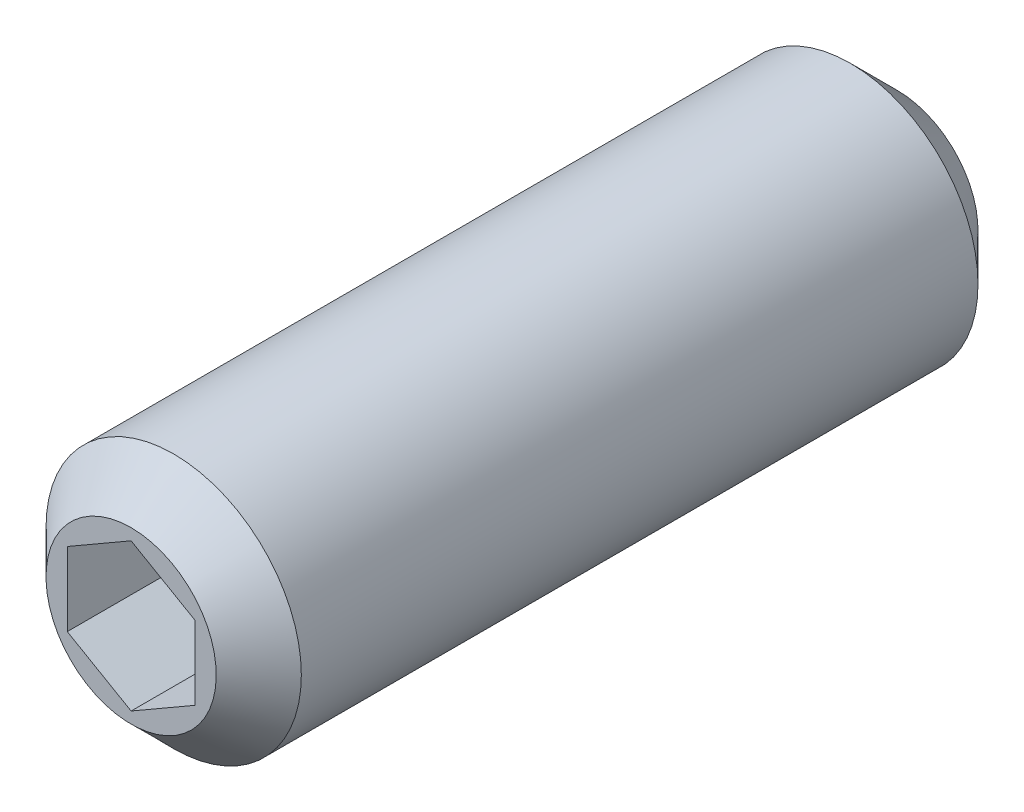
ISO-10303-21;
HEADER;
FILE_DESCRIPTION(('STEP AP214'),'2;1');
FILE_NAME('part.step','',(''),(''),'','','');
FILE_SCHEMA(('AUTOMOTIVE_DESIGN { 1 0 10303 214 1 1 1 1 }'));
ENDSEC;
DATA;
#1=APPLICATION_CONTEXT('core data for automotive mechanical design processes');
#2=APPLICATION_PROTOCOL_DEFINITION('international standard','automotive_design',2000,#1);
#3=PRODUCT_CONTEXT('',#1,'mechanical');
#4=PRODUCT('Part','Part','',(#3));
#5=PRODUCT_RELATED_PRODUCT_CATEGORY('part','',(#4));
#6=PRODUCT_DEFINITION_FORMATION('','',#4);
#7=PRODUCT_DEFINITION_CONTEXT('part definition',#1,'design');
#8=PRODUCT_DEFINITION('design','',#6,#7);
#9=PRODUCT_DEFINITION_SHAPE('','',#8);
#10=(LENGTH_UNIT() NAMED_UNIT(*) SI_UNIT(.MILLI.,.METRE.));
#11=(NAMED_UNIT(*) PLANE_ANGLE_UNIT() SI_UNIT($,.RADIAN.));
#12=(NAMED_UNIT(*) SI_UNIT($,.STERADIAN.) SOLID_ANGLE_UNIT());
#13=UNCERTAINTY_MEASURE_WITH_UNIT(LENGTH_MEASURE(1.E-05),#10,'distance_accuracy_value','');
#14=(GEOMETRIC_REPRESENTATION_CONTEXT(3) GLOBAL_UNCERTAINTY_ASSIGNED_CONTEXT((#13)) GLOBAL_UNIT_ASSIGNED_CONTEXT((#10,
#11,#12)) REPRESENTATION_CONTEXT('',''));
#15=CARTESIAN_POINT('',(0.,0.,0.));
#16=DIRECTION('',(0.,0.,1.));
#17=DIRECTION('',(1.,0.,0.));
#18=AXIS2_PLACEMENT_3D('',#15,#16,#17);
#19=CARTESIAN_POINT('',(0.,0.,9.5));
#20=DIRECTION('',(0.,0.,-1.));
#21=DIRECTION('',(0.,1.,0.));
#22=AXIS2_PLACEMENT_3D('',#19,#20,#21);
#23=PLANE('',#22);
#24=DIRECTION('',(0.866025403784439,0.5,0.));
#25=VECTOR('',#24,1.);
#26=CARTESIAN_POINT('',(0.,-0.866025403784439,9.5));
#27=LINE('',#26,#25);
#28=CARTESIAN_POINT('',(0.,-0.866025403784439,9.5));
#29=VERTEX_POINT('',#28);
#30=CARTESIAN_POINT('',(0.75,-0.43301270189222,9.5));
#31=VERTEX_POINT('',#30);
#32=EDGE_CURVE('E83',#29,#31,#27,.T.);
#33=ORIENTED_EDGE('',*,*,#32,.F.);
#34=DIRECTION('',(0.866025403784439,-0.5,0.));
#35=VECTOR('',#34,1.);
#36=CARTESIAN_POINT('',(-0.75,-0.43301270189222,9.5));
#37=LINE('',#36,#35);
#38=CARTESIAN_POINT('',(-0.75,-0.43301270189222,9.5));
#39=VERTEX_POINT('',#38);
#40=EDGE_CURVE('E29',#39,#29,#37,.T.);
#41=ORIENTED_EDGE('',*,*,#40,.F.);
#42=DIRECTION('',(0.,-1.,0.));
#43=VECTOR('',#42,1.);
#44=CARTESIAN_POINT('',(-0.75,0.433012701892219,9.5));
#45=LINE('',#44,#43);
#46=CARTESIAN_POINT('',(-0.75,0.433012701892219,9.5));
#47=VERTEX_POINT('',#46);
#48=EDGE_CURVE('E98',#47,#39,#45,.T.);
#49=ORIENTED_EDGE('',*,*,#48,.F.);
#50=DIRECTION('',(-0.866025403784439,-0.5,0.));
#51=VECTOR('',#50,1.);
#52=CARTESIAN_POINT('',(0.,0.866025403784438,9.5));
#53=LINE('',#52,#51);
#54=CARTESIAN_POINT('',(0.,0.866025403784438,9.5));
#55=VERTEX_POINT('',#54);
#56=EDGE_CURVE('E92',#55,#47,#53,.T.);
#57=ORIENTED_EDGE('',*,*,#56,.F.);
#58=DIRECTION('',(-0.866025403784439,0.5,0.));
#59=VECTOR('',#58,1.);
#60=CARTESIAN_POINT('',(0.75,0.433012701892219,9.5));
#61=LINE('',#60,#59);
#62=CARTESIAN_POINT('',(0.75,0.433012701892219,9.5));
#63=VERTEX_POINT('',#62);
#64=EDGE_CURVE('E90',#63,#55,#61,.T.);
#65=ORIENTED_EDGE('',*,*,#64,.F.);
#66=DIRECTION('',(0.,1.,0.));
#67=VECTOR('',#66,1.);
#68=CARTESIAN_POINT('',(0.75,-0.43301270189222,9.5));
#69=LINE('',#68,#67);
#70=EDGE_CURVE('E72',#31,#63,#69,.T.);
#71=ORIENTED_EDGE('',*,*,#70,.F.);
#72=EDGE_LOOP('',(#33,#41,#49,#57,#65,#71));
#73=FACE_BOUND('',#72,.T.);
#74=CARTESIAN_POINT('',(0.,0.,9.5));
#75=DIRECTION('',(0.,0.,-1.));
#76=DIRECTION('',(0.,1.,0.));
#77=AXIS2_PLACEMENT_3D('',#74,#75,#76);
#78=CIRCLE('',#77,1.);
#79=CARTESIAN_POINT('',(0.,1.,9.5));
#80=VERTEX_POINT('',#79);
#81=EDGE_CURVE('E9',#80,#80,#78,.F.);
#82=ORIENTED_EDGE('',*,*,#81,.T.);
#83=EDGE_LOOP('',(#82));
#84=FACE_BOUND('',#83,.T.);
#85=ADVANCED_FACE('F14',(#73,#84),#23,.F.);
#86=CARTESIAN_POINT('',(0.,0.,0.5));
#87=DIRECTION('',(0.,0.,1.));
#88=DIRECTION('',(0.,-1.,0.));
#89=AXIS2_PLACEMENT_3D('',#86,#87,#88);
#90=CYLINDRICAL_SURFACE('',#89,1.5);
#91=CARTESIAN_POINT('',(0.,0.,9.));
#92=DIRECTION('',(0.,0.,-1.));
#93=DIRECTION('',(0.,1.,0.));
#94=AXIS2_PLACEMENT_3D('',#91,#92,#93);
#95=CIRCLE('',#94,1.5);
#96=CARTESIAN_POINT('',(0.,1.5,9.));
#97=VERTEX_POINT('',#96);
#98=EDGE_CURVE('E22',#97,#97,#95,.T.);
#99=ORIENTED_EDGE('',*,*,#98,.T.);
#100=EDGE_LOOP('',(#99));
#101=FACE_BOUND('',#100,.T.);
#102=CARTESIAN_POINT('',(0.,0.,1.05));
#103=DIRECTION('',(0.,0.,-1.));
#104=DIRECTION('',(-1.,0.,0.));
#105=AXIS2_PLACEMENT_3D('',#102,#103,#104);
#106=CIRCLE('',#105,1.5);
#107=CARTESIAN_POINT('',(-1.5,0.,1.05));
#108=VERTEX_POINT('',#107);
#109=EDGE_CURVE('E267',#108,#108,#106,.T.);
#110=ORIENTED_EDGE('',*,*,#109,.F.);
#111=EDGE_LOOP('',(#110));
#112=FACE_BOUND('',#111,.T.);
#113=ADVANCED_FACE('F16',(#101,#112),#90,.T.);
#114=CARTESIAN_POINT('',(0.,0.,9.));
#115=DIRECTION('',(0.,0.,-1.));
#116=DIRECTION('',(0.,1.,0.));
#117=AXIS2_PLACEMENT_3D('',#114,#115,#116);
#118=CONICAL_SURFACE('',#117,1.5,0.78539816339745);
#119=ORIENTED_EDGE('',*,*,#81,.F.);
#120=EDGE_LOOP('',(#119));
#121=FACE_BOUND('',#120,.T.);
#122=ORIENTED_EDGE('',*,*,#98,.F.);
#123=EDGE_LOOP('',(#122));
#124=FACE_BOUND('',#123,.T.);
#125=ADVANCED_FACE('F132',(#121,#124),#118,.T.);
#126=CARTESIAN_POINT('',(-0.75,-0.43301270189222,7.5));
#127=DIRECTION('',(-0.5,-0.866025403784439,0.));
#128=DIRECTION('',(-0.866025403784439,0.5,0.));
#129=AXIS2_PLACEMENT_3D('',#126,#127,#128);
#130=PLANE('',#129);
#131=ORIENTED_EDGE('',*,*,#40,.T.);
#132=DIRECTION('',(0.,0.,1.));
#133=VECTOR('',#132,1.);
#134=CARTESIAN_POINT('',(0.,-0.866025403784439,7.5));
#135=LINE('',#134,#133);
#136=CARTESIAN_POINT('',(0.,-0.866025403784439,7.5));
#137=VERTEX_POINT('',#136);
#138=EDGE_CURVE('E80',#137,#29,#135,.T.);
#139=ORIENTED_EDGE('',*,*,#138,.F.);
#140=DIRECTION('',(0.866025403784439,-0.5,0.));
#141=VECTOR('',#140,1.);
#142=CARTESIAN_POINT('',(-0.75,-0.43301270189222,7.5));
#143=LINE('',#142,#141);
#144=CARTESIAN_POINT('',(-0.75,-0.43301270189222,7.5));
#145=VERTEX_POINT('',#144);
#146=EDGE_CURVE('E100',#145,#137,#143,.T.);
#147=ORIENTED_EDGE('',*,*,#146,.F.);
#148=DIRECTION('',(0.,0.,1.));
#149=VECTOR('',#148,1.);
#150=CARTESIAN_POINT('',(-0.75,-0.43301270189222,7.5));
#151=LINE('',#150,#149);
#152=EDGE_CURVE('E36',#145,#39,#151,.T.);
#153=ORIENTED_EDGE('',*,*,#152,.T.);
#154=EDGE_LOOP('',(#131,#139,#147,#153));
#155=FACE_BOUND('',#154,.T.);
#156=ADVANCED_FACE('F134',(#155),#130,.F.);
#157=CARTESIAN_POINT('',(-0.75,0.433012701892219,7.5));
#158=DIRECTION('',(-1.,0.,0.));
#159=DIRECTION('',(0.,1.,0.));
#160=AXIS2_PLACEMENT_3D('',#157,#158,#159);
#161=PLANE('',#160);
#162=ORIENTED_EDGE('',*,*,#48,.T.);
#163=ORIENTED_EDGE('',*,*,#152,.F.);
#164=DIRECTION('',(0.,-1.,0.));
#165=VECTOR('',#164,1.);
#166=CARTESIAN_POINT('',(-0.75,0.433012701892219,7.5));
#167=LINE('',#166,#165);
#168=CARTESIAN_POINT('',(-0.75,0.433012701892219,7.5));
#169=VERTEX_POINT('',#168);
#170=EDGE_CURVE('E112',#169,#145,#167,.T.);
#171=ORIENTED_EDGE('',*,*,#170,.F.);
#172=DIRECTION('',(0.,0.,1.));
#173=VECTOR('',#172,1.);
#174=CARTESIAN_POINT('',(-0.75,0.433012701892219,7.5));
#175=LINE('',#174,#173);
#176=EDGE_CURVE('E117',#169,#47,#175,.T.);
#177=ORIENTED_EDGE('',*,*,#176,.T.);
#178=EDGE_LOOP('',(#162,#163,#171,#177));
#179=FACE_BOUND('',#178,.T.);
#180=ADVANCED_FACE('F142',(#179),#161,.F.);
#181=CARTESIAN_POINT('',(0.,0.866025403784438,7.5));
#182=DIRECTION('',(-0.5,0.866025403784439,0.));
#183=DIRECTION('',(0.866025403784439,0.5,0.));
#184=AXIS2_PLACEMENT_3D('',#181,#182,#183);
#185=PLANE('',#184);
#186=ORIENTED_EDGE('',*,*,#56,.T.);
#187=ORIENTED_EDGE('',*,*,#176,.F.);
#188=DIRECTION('',(-0.866025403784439,-0.5,0.));
#189=VECTOR('',#188,1.);
#190=CARTESIAN_POINT('',(0.,0.866025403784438,7.5));
#191=LINE('',#190,#189);
#192=CARTESIAN_POINT('',(0.,0.866025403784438,7.5));
#193=VERTEX_POINT('',#192);
#194=EDGE_CURVE('E109',#193,#169,#191,.T.);
#195=ORIENTED_EDGE('',*,*,#194,.F.);
#196=DIRECTION('',(0.,0.,1.));
#197=VECTOR('',#196,1.);
#198=CARTESIAN_POINT('',(0.,0.866025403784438,7.5));
#199=LINE('',#198,#197);
#200=EDGE_CURVE('E119',#193,#55,#199,.T.);
#201=ORIENTED_EDGE('',*,*,#200,.T.);
#202=EDGE_LOOP('',(#186,#187,#195,#201));
#203=FACE_BOUND('',#202,.T.);
#204=ADVANCED_FACE('F176',(#203),#185,.F.);
#205=CARTESIAN_POINT('',(0.75,0.433012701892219,7.5));
#206=DIRECTION('',(0.5,0.866025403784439,0.));
#207=DIRECTION('',(0.866025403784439,-0.5,0.));
#208=AXIS2_PLACEMENT_3D('',#205,#206,#207);
#209=PLANE('',#208);
#210=ORIENTED_EDGE('',*,*,#64,.T.);
#211=ORIENTED_EDGE('',*,*,#200,.F.);
#212=DIRECTION('',(-0.866025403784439,0.5,0.));
#213=VECTOR('',#212,1.);
#214=CARTESIAN_POINT('',(0.75,0.433012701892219,7.5));
#215=LINE('',#214,#213);
#216=CARTESIAN_POINT('',(0.75,0.433012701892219,7.5));
#217=VERTEX_POINT('',#216);
#218=EDGE_CURVE('E106',#217,#193,#215,.T.);
#219=ORIENTED_EDGE('',*,*,#218,.F.);
#220=DIRECTION('',(0.,0.,1.));
#221=VECTOR('',#220,1.);
#222=CARTESIAN_POINT('',(0.75,0.433012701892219,7.5));
#223=LINE('',#222,#221);
#224=EDGE_CURVE('E79',#217,#63,#223,.T.);
#225=ORIENTED_EDGE('',*,*,#224,.T.);
#226=EDGE_LOOP('',(#210,#211,#219,#225));
#227=FACE_BOUND('',#226,.T.);
#228=ADVANCED_FACE('F179',(#227),#209,.F.);
#229=CARTESIAN_POINT('',(0.75,-0.43301270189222,7.5));
#230=DIRECTION('',(1.,0.,0.));
#231=DIRECTION('',(0.,-1.,0.));
#232=AXIS2_PLACEMENT_3D('',#229,#230,#231);
#233=PLANE('',#232);
#234=ORIENTED_EDGE('',*,*,#70,.T.);
#235=ORIENTED_EDGE('',*,*,#224,.F.);
#236=DIRECTION('',(0.,1.,0.));
#237=VECTOR('',#236,1.);
#238=CARTESIAN_POINT('',(0.75,-0.43301270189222,7.5));
#239=LINE('',#238,#237);
#240=CARTESIAN_POINT('',(0.75,-0.43301270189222,7.5));
#241=VERTEX_POINT('',#240);
#242=EDGE_CURVE('E75',#241,#217,#239,.T.);
#243=ORIENTED_EDGE('',*,*,#242,.F.);
#244=DIRECTION('',(0.,0.,1.));
#245=VECTOR('',#244,1.);
#246=CARTESIAN_POINT('',(0.75,-0.43301270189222,7.5));
#247=LINE('',#246,#245);
#248=EDGE_CURVE('E68',#241,#31,#247,.T.);
#249=ORIENTED_EDGE('',*,*,#248,.T.);
#250=EDGE_LOOP('',(#234,#235,#243,#249));
#251=FACE_BOUND('',#250,.T.);
#252=ADVANCED_FACE('F70',(#251),#233,.F.);
#253=CARTESIAN_POINT('',(0.,-0.866025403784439,7.5));
#254=DIRECTION('',(0.5,-0.866025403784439,0.));
#255=DIRECTION('',(-0.866025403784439,-0.5,0.));
#256=AXIS2_PLACEMENT_3D('',#253,#254,#255);
#257=PLANE('',#256);
#258=ORIENTED_EDGE('',*,*,#32,.T.);
#259=ORIENTED_EDGE('',*,*,#248,.F.);
#260=DIRECTION('',(0.866025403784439,0.5,0.));
#261=VECTOR('',#260,1.);
#262=CARTESIAN_POINT('',(0.,-0.866025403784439,7.5));
#263=LINE('',#262,#261);
#264=EDGE_CURVE('E103',#137,#241,#263,.T.);
#265=ORIENTED_EDGE('',*,*,#264,.F.);
#266=ORIENTED_EDGE('',*,*,#138,.T.);
#267=EDGE_LOOP('',(#258,#259,#265,#266));
#268=FACE_BOUND('',#267,.T.);
#269=ADVANCED_FACE('F84',(#268),#257,.F.);
#270=CARTESIAN_POINT('',(-0.75,-0.43301270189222,7.5));
#271=DIRECTION('',(0.,0.,-1.));
#272=DIRECTION('',(0.,1.,0.));
#273=AXIS2_PLACEMENT_3D('',#270,#271,#272);
#274=PLANE('',#273);
#275=ORIENTED_EDGE('',*,*,#146,.T.);
#276=ORIENTED_EDGE('',*,*,#264,.T.);
#277=ORIENTED_EDGE('',*,*,#242,.T.);
#278=ORIENTED_EDGE('',*,*,#218,.T.);
#279=ORIENTED_EDGE('',*,*,#194,.T.);
#280=ORIENTED_EDGE('',*,*,#170,.T.);
#281=EDGE_LOOP('',(#275,#276,#277,#278,#279,#280));
#282=FACE_BOUND('',#281,.T.);
#283=ADVANCED_FACE('F164',(#282),#274,.F.);
#284=CARTESIAN_POINT('',(0.,0.,0.5));
#285=DIRECTION('',(0.,0.,1.));
#286=DIRECTION('',(1.,0.,0.));
#287=AXIS2_PLACEMENT_3D('',#284,#285,#286);
#288=CONICAL_SURFACE('',#287,0.95,0.785398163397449);
#289=ORIENTED_EDGE('',*,*,#109,.T.);
#290=EDGE_LOOP('',(#289));
#291=FACE_BOUND('',#290,.T.);
#292=CARTESIAN_POINT('',(0.,0.,0.5));
#293=DIRECTION('',(0.,0.,-1.));
#294=DIRECTION('',(0.,1.,0.));
#295=AXIS2_PLACEMENT_3D('',#292,#293,#294);
#296=CIRCLE('',#295,0.95);
#297=CARTESIAN_POINT('',(0.,0.95,0.5));
#298=VERTEX_POINT('',#297);
#299=EDGE_CURVE('E116',#298,#298,#296,.F.);
#300=ORIENTED_EDGE('',*,*,#299,.T.);
#301=EDGE_LOOP('',(#300));
#302=FACE_BOUND('',#301,.T.);
#303=ADVANCED_FACE('F157',(#291,#302),#288,.T.);
#304=CARTESIAN_POINT('',(0.,0.,0.75));
#305=DIRECTION('',(0.,0.,-1.));
#306=DIRECTION('',(1.,0.,0.));
#307=AXIS2_PLACEMENT_3D('',#304,#305,#306);
#308=SPHERICAL_SURFACE('',#307,0.75);
#309=CARTESIAN_POINT('',(0.,0.,0.5));
#310=DIRECTION('',(0.,0.,-1.));
#311=DIRECTION('',(0.,1.,0.));
#312=AXIS2_PLACEMENT_3D('',#309,#310,#311);
#313=CIRCLE('',#312,0.707106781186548);
#314=CARTESIAN_POINT('',(0.,0.707106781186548,0.5));
#315=VERTEX_POINT('',#314);
#316=EDGE_CURVE('E123',#315,#315,#313,.F.);
#317=ORIENTED_EDGE('',*,*,#316,.F.);
#318=EDGE_LOOP('',(#317));
#319=FACE_BOUND('',#318,.T.);
#320=ADVANCED_FACE('F150',(#319),#308,.T.);
#321=CARTESIAN_POINT('',(0.,0.,0.5));
#322=DIRECTION('',(0.,0.,-1.));
#323=DIRECTION('',(0.,1.,0.));
#324=AXIS2_PLACEMENT_3D('',#321,#322,#323);
#325=PLANE('',#324);
#326=ORIENTED_EDGE('',*,*,#299,.F.);
#327=EDGE_LOOP('',(#326));
#328=FACE_BOUND('',#327,.T.);
#329=ORIENTED_EDGE('',*,*,#316,.T.);
#330=EDGE_LOOP('',(#329));
#331=FACE_BOUND('',#330,.T.);
#332=ADVANCED_FACE('F151',(#328,#331),#325,.T.);
#333=CLOSED_SHELL('',(#85,#113,#125,#156,#180,#204,#228,#252,#269,#283,#303,#320,#332));
#334=MANIFOLD_SOLID_BREP('B1',#333);
#335=ADVANCED_BREP_SHAPE_REPRESENTATION('',(#18,#334),#14);
#336=SHAPE_DEFINITION_REPRESENTATION(#9,#335);
ENDSEC;
END-ISO-10303-21;
